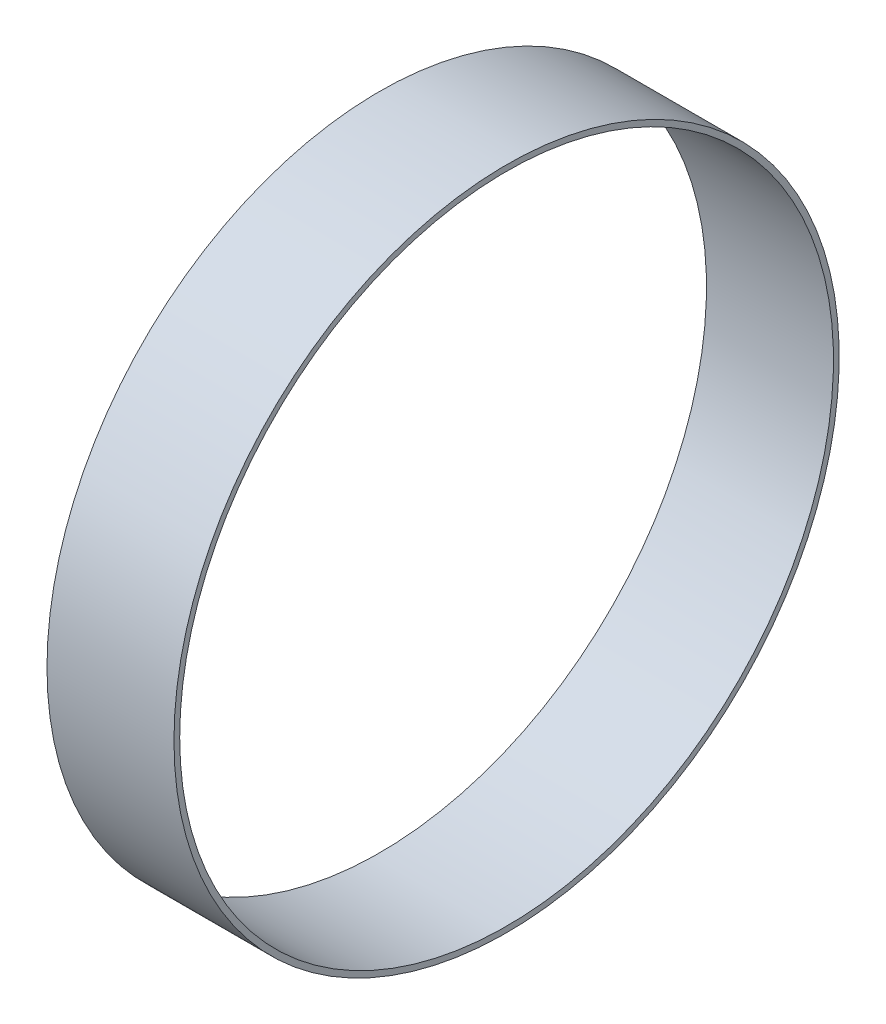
from build123d import *

# Parameters (mm, degrees)
SKETCH1_R           = 147.2438
SKETCH1_R_2         = 144.7038
BOSS_EXTRUDE1_DEPTH = 56.2102


with BuildPart() as part:
    # Sketch1 → Boss-Extrude1 (new body)
    with BuildSketch(Plane(origin=(0, 0, 0), x_dir=(0, 0, -1), z_dir=(1, 0, 0))):
        with Locations(Location((0, 0, 0), (0, 0, 180))):
            Circle(SKETCH1_R)
        with Locations(Location((0, 0, 0), (0, 0, 180))):
            Circle(SKETCH1_R_2, mode=Mode.SUBTRACT)
    extrude(amount=BOSS_EXTRUDE1_DEPTH)


solid = part.part
